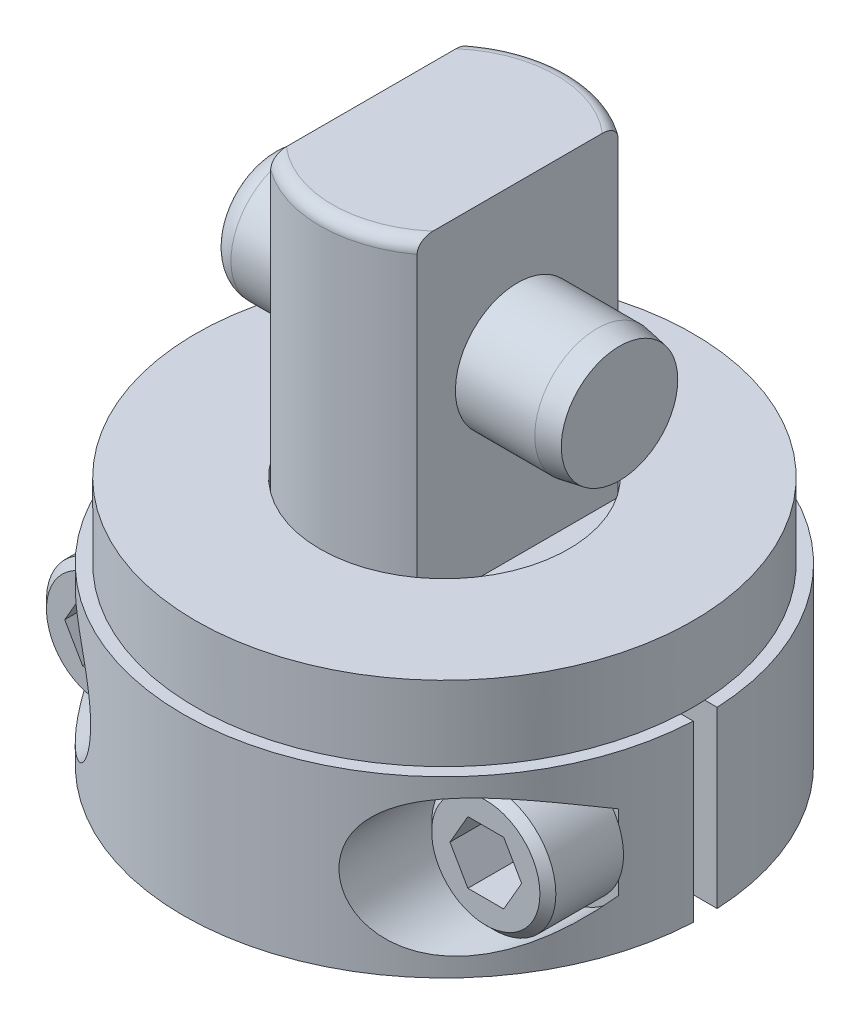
from build123d import *

# Parameters (mm, degrees)
FILLET1_R                  = 0.7874
CUT_EXTRUDE1_DEPTH         = 32.079404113
CUT_EXTRUDE1_DEPTH_BACK    = 32.079404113
SKETCH2_W                  = 3.2639
SKETCH2_H                  = 20.6248
CUT_EXTRUDE2_START         = 2.54
SKETCH3_R                  = 4.7625
SKETCH3_R_2                = 4.064
CUT_EXTRUDE2_DEPTH         = 2.54
CHAMFER1_SIZE              = 0.762
SKETCH4_R                  = 3.97129
EXTRUDE1_DEPTH             = 11.176
CHAMFER2_SIZE              = 0.254
CHAMFER2_SIZE2             = 1.440505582
FILLET2_R                  = 1.524
EXTRUDE2_DEPTH             = 5.5626
EXTRUDE2_DEPTH_BACK        = 5.5626
CUT_EXTRUDE3_START         = 4.064
SKETCH6_R                  = 4.3688
CUT_EXTRUDE3_DEPTH         = 34.626664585
SKETCH7_R                  = 3.9624
EXTRUDE3_DEPTH             = 4.826
CHAMFER3_SIZE              = 0.508
CUT_EXTRUDE4_DEPTH         = 3.9624
EXTRUDE4_REACH             = 39.345
SKETCH10_R                 = 2.413
EXTRUDE4_DIRECTION_2_REACH = 39.345
SKETCH11_R                 = 15.875
SKETCH11_R_2               = 7.9375
EXTRUDE5_DEPTH             = 4.7752


with BuildPart() as part:
    # Sketch1 → Revolve1 (revolve)
    with BuildSketch(Plane(origin=(0, 0, 0), x_dir=(0, 0, -1), z_dir=(1, 0, 0))):
        Polygon((0, 28.9814), (7.9375, 28.9814), (7.9375, 0), (4.7625, 0), (4.7625, -11.176), (0, -11.176), align=None)
    revolve(axis=Axis((0, -15.35938, 0), (0, 1, 0)))

    # Fillet1
    fillet1_edges = [part.edges().sort_by_distance(p)[0] for p in [
        (0, 28.9814, 7.9375),
    ]]
    fillet(fillet1_edges, radius=FILLET1_R)

    # Sketch2 → Cut-Extrude1 (cut, two sides: drawn at the far end of the back side and taken through both)
    with BuildSketch(Plane.XY.offset(-CUT_EXTRUDE1_DEPTH_BACK)):
        with Locations((6.30555, 18.669)):
            Rectangle(SKETCH2_W, SKETCH2_H)
        with Locations((-6.30555, 18.669)):
            Rectangle(SKETCH2_W, SKETCH2_H)
    extrude(amount=CUT_EXTRUDE1_DEPTH + CUT_EXTRUDE1_DEPTH_BACK, mode=Mode.SUBTRACT)

    # Sketch3 → Cut-Extrude2 (cut)
    with BuildSketch(Plane.XZ.offset(CUT_EXTRUDE2_START)):
        with Locations(Location((0, 0, 0), (0, 0, 270))):
            Circle(SKETCH3_R)
        with Locations(Location((0, 0, 0), (0, 0, 270))):
            Circle(SKETCH3_R_2, mode=Mode.SUBTRACT)
    extrude(amount=-CUT_EXTRUDE2_DEPTH, mode=Mode.SUBTRACT)

    # Chamfer1
    chamfer1_edges = [part.edges().sort_by_distance(p)[0] for p in [
        (0, -11.176, 4.7625),
    ]]
    chamfer(chamfer1_edges, length=CHAMFER1_SIZE)

    # Sketch4 → Extrude1 (add, symmetric)
    with BuildSketch(Plane(origin=(0, 0, 0), x_dir=(0, 0, -1), z_dir=(1, 0, 0))):
        with Locations(Location((0, 19.4564, 0), (0, 0, 90))):
            Circle(SKETCH4_R)
    extrude(amount=EXTRUDE1_DEPTH, both=True)

    # Chamfer2
    chamfer2_edges = [part.edges().sort_by_distance(p)[0] for p in [
        (11.176, 15.48511, 0),
    ]]
    chamfer2_side = [part.faces().sort_by_distance(p)[0] for p in [
        (11.176, 19.4564, 0),
    ]]
    chamfer(chamfer2_edges, length=CHAMFER2_SIZE, length2=CHAMFER2_SIZE2, reference=chamfer2_side[0])

    # Fillet2
    fillet2_edges = [part.edges().sort_by_distance(p)[0] for p in [
        (-11.176, 15.48511, 0),
    ]]
    fillet(fillet2_edges, radius=FILLET2_R)

    # Sketch5 → Extrude2 (add, two sides: drawn at the far end of the back side and taken through both)
    with BuildSketch(Plane(origin=(0, 0, 0), x_dir=(1, 0, 0), z_dir=(0, 1, 0)).offset(-EXTRUDE2_DEPTH_BACK)):
        with BuildLine():
            Line((7.900839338, 0.762), (16.6449671, 0.762))
            ThreePointArc((16.6449671, 0.762), (0, 16.6624), (-16.6449671, 0.762))
            Line((-16.6449671, 0.762), (-7.900839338, 0.762))
            ThreePointArc((-7.900839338, 0.762), (0, 7.9375), (7.900839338, 0.762))
        make_face()
        with BuildLine():
            Line((7.900839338, -0.762), (16.6449671, -0.762))
            ThreePointArc((16.6449671, -0.762), (0, -16.6624), (-16.6449671, -0.762))
            Line((-16.6449671, -0.762), (-7.900839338, -0.762))
            ThreePointArc((-7.900839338, -0.762), (0, -7.9375), (7.900839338, -0.762))
        make_face()
    extrude(amount=EXTRUDE2_DEPTH + EXTRUDE2_DEPTH_BACK)

    # Sketch6 → Cut-Extrude3 (cut, through all)
    with BuildSketch(Plane.XY.offset(0.762).offset(CUT_EXTRUDE3_START)):
        with Locations((12.2936, 0)):
            Circle(SKETCH6_R)
        with Locations((-12.2936, 0)):
            Circle(SKETCH6_R)
    extrude(amount=CUT_EXTRUDE3_DEPTH, mode=Mode.SUBTRACT)

    # Sketch7 → Extrude3 (add)
    with BuildSketch(Plane.XY.offset(4.826)):
        with Locations(Location((12.2936, 0, 0), (0, 0, 337.267864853))):
            Circle(SKETCH7_R)
        with Locations(Location((-12.2936, 0, 0), (0, 0, 157.267864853))):
            Circle(SKETCH7_R)
    extrude(amount=EXTRUDE3_DEPTH)

    # Chamfer3
    chamfer3_edges = [part.edges().sort_by_distance(p)[0] for p in [
        (8.638993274, 1.531164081, 9.652),
        (-8.638993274, -1.531164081, 9.652),
    ]]
    chamfer(chamfer3_edges, length=CHAMFER3_SIZE)

    # Sketch8 → Cut-Extrude4 (cut)
    with BuildSketch(Plane.XY.offset(9.652)):
        Polygon((13.437446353, 1.9812), (14.581292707, 0), (13.437446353, -1.9812), (11.149753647, -1.9812), (10.005907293, 0), (11.149753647, 1.9812), align=None)
        Polygon((-14.581292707, 0), (-13.437446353, -1.9812), (-11.149753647, -1.9812), (-10.005907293, 0), (-11.149753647, 1.9812), (-13.437446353, 1.9812), align=None)
    extrude(amount=-CUT_EXTRUDE4_DEPTH, mode=Mode.SUBTRACT)

    # Sketch10 → Extrude4 (add, up to next)
    with BuildSketch(Plane.XY, mode=Mode.PRIVATE) as extrude4_sk1:
        with Locations((12.2936, 0)):
            Circle(SKETCH10_R)
    extrude4_tool1 = extrude(extrude4_sk1.sketch, amount=EXTRUDE4_REACH, mode=Mode.PRIVATE) - part.part
    # Sketch10 → Extrude4 (add, up to next)
    with BuildSketch(Plane.XY, mode=Mode.PRIVATE) as extrude4_sk2:
        with Locations((-12.2936, 0)):
            Circle(SKETCH10_R)
    extrude4_tool2 = extrude(extrude4_sk2.sketch, amount=EXTRUDE4_REACH, mode=Mode.PRIVATE) - part.part
    add(extrude4_tool1.solids().sort_by_distance((12.2936, 0, 0))[0])
    add(extrude4_tool2.solids().sort_by_distance((-12.2936, 0, 0))[0])

    # Sketch10 → Extrude4 direction 2 (add, up to next)
    with BuildSketch(Plane.XY, mode=Mode.PRIVATE) as extrude4_direction_2_sk1:
        with Locations((12.2936, 0)):
            Circle(SKETCH10_R)
    extrude4_direction_2_tool1 = extrude(extrude4_direction_2_sk1.sketch, amount=-EXTRUDE4_DIRECTION_2_REACH, mode=Mode.PRIVATE) - part.part
    # Sketch10 → Extrude4 direction 2 (add, up to next)
    with BuildSketch(Plane.XY, mode=Mode.PRIVATE) as extrude4_direction_2_sk2:
        with Locations((-12.2936, 0)):
            Circle(SKETCH10_R)
    extrude4_direction_2_tool2 = extrude(extrude4_direction_2_sk2.sketch, amount=-EXTRUDE4_DIRECTION_2_REACH, mode=Mode.PRIVATE) - part.part
    add(extrude4_direction_2_tool1.solids().sort_by_distance((12.2936, 0, 0))[0])
    add(extrude4_direction_2_tool2.solids().sort_by_distance((-12.2936, 0, 0))[0])

    # Sketch11 → Extrude5 (add)
    with BuildSketch(Plane(origin=(0, 5.5626, 0), x_dir=(-1, 0, 0), z_dir=(0, 1, 0))):
        with Locations(Location((0, 0, 0), (0, 0, 182.751254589))):
            Circle(SKETCH11_R)
        Circle(SKETCH11_R_2, mode=Mode.SUBTRACT)
    extrude(amount=EXTRUDE5_DEPTH)


solid = part.part
